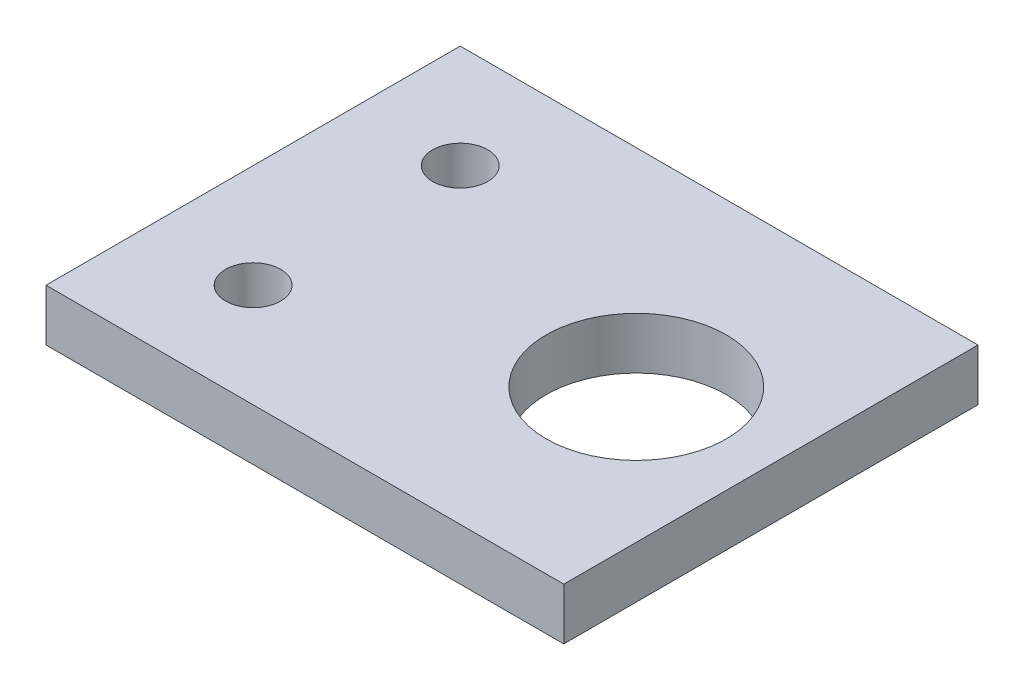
ISO-10303-21;
HEADER;
FILE_DESCRIPTION(('STEP AP214'),'2;1');
FILE_NAME('part.step','',(''),(''),'','','');
FILE_SCHEMA(('AUTOMOTIVE_DESIGN { 1 0 10303 214 1 1 1 1 }'));
ENDSEC;
DATA;
#1=APPLICATION_CONTEXT('core data for automotive mechanical design processes');
#2=APPLICATION_PROTOCOL_DEFINITION('international standard','automotive_design',2000,#1);
#3=PRODUCT_CONTEXT('',#1,'mechanical');
#4=PRODUCT('Part','Part','',(#3));
#5=PRODUCT_RELATED_PRODUCT_CATEGORY('part','',(#4));
#6=PRODUCT_DEFINITION_FORMATION('','',#4);
#7=PRODUCT_DEFINITION_CONTEXT('part definition',#1,'design');
#8=PRODUCT_DEFINITION('design','',#6,#7);
#9=PRODUCT_DEFINITION_SHAPE('','',#8);
#10=(LENGTH_UNIT() NAMED_UNIT(*) SI_UNIT(.MILLI.,.METRE.));
#11=(NAMED_UNIT(*) PLANE_ANGLE_UNIT() SI_UNIT($,.RADIAN.));
#12=(NAMED_UNIT(*) SI_UNIT($,.STERADIAN.) SOLID_ANGLE_UNIT());
#13=UNCERTAINTY_MEASURE_WITH_UNIT(LENGTH_MEASURE(1.E-05),#10,'distance_accuracy_value','');
#14=(GEOMETRIC_REPRESENTATION_CONTEXT(3) GLOBAL_UNCERTAINTY_ASSIGNED_CONTEXT((#13)) GLOBAL_UNIT_ASSIGNED_CONTEXT((#10,
#11,#12)) REPRESENTATION_CONTEXT('',''));
#15=CARTESIAN_POINT('',(0.,0.,0.));
#16=DIRECTION('',(0.,0.,1.));
#17=DIRECTION('',(1.,0.,0.));
#18=AXIS2_PLACEMENT_3D('',#15,#16,#17);
#19=CARTESIAN_POINT('',(-31.75,6.35,-25.4));
#20=DIRECTION('',(1.,0.,0.));
#21=DIRECTION('',(0.,0.,-1.));
#22=AXIS2_PLACEMENT_3D('',#19,#20,#21);
#23=PLANE('',#22);
#24=DIRECTION('',(0.,0.,1.));
#25=VECTOR('',#24,1.);
#26=CARTESIAN_POINT('',(-31.75,0.,-25.4));
#27=LINE('',#26,#25);
#28=CARTESIAN_POINT('',(-31.75,0.,-25.4));
#29=VERTEX_POINT('',#28);
#30=CARTESIAN_POINT('',(-31.75,0.,25.4));
#31=VERTEX_POINT('',#30);
#32=EDGE_CURVE('E119',#29,#31,#27,.T.);
#33=ORIENTED_EDGE('',*,*,#32,.T.);
#34=DIRECTION('',(0.,-1.,0.));
#35=VECTOR('',#34,1.);
#36=CARTESIAN_POINT('',(-31.75,6.35,25.4));
#37=LINE('',#36,#35);
#38=CARTESIAN_POINT('',(-31.75,6.35,25.4));
#39=VERTEX_POINT('',#38);
#40=EDGE_CURVE('E13',#39,#31,#37,.T.);
#41=ORIENTED_EDGE('',*,*,#40,.F.);
#42=DIRECTION('',(0.,0.,1.));
#43=VECTOR('',#42,1.);
#44=CARTESIAN_POINT('',(-31.75,6.35,-25.4));
#45=LINE('',#44,#43);
#46=CARTESIAN_POINT('',(-31.75,6.35,-25.4));
#47=VERTEX_POINT('',#46);
#48=EDGE_CURVE('E102',#47,#39,#45,.T.);
#49=ORIENTED_EDGE('',*,*,#48,.F.);
#50=DIRECTION('',(0.,-1.,0.));
#51=VECTOR('',#50,1.);
#52=CARTESIAN_POINT('',(-31.75,6.35,-25.4));
#53=LINE('',#52,#51);
#54=EDGE_CURVE('E115',#47,#29,#53,.T.);
#55=ORIENTED_EDGE('',*,*,#54,.T.);
#56=EDGE_LOOP('',(#33,#41,#49,#55));
#57=FACE_BOUND('',#56,.T.);
#58=ADVANCED_FACE('F50',(#57),#23,.F.);
#59=CARTESIAN_POINT('',(31.75,6.35,25.4));
#60=DIRECTION('',(0.,0.,-1.));
#61=DIRECTION('',(-1.,0.,0.));
#62=AXIS2_PLACEMENT_3D('',#59,#60,#61);
#63=PLANE('',#62);
#64=DIRECTION('',(1.,0.,0.));
#65=VECTOR('',#64,1.);
#66=CARTESIAN_POINT('',(31.75,0.,25.4));
#67=LINE('',#66,#65);
#68=CARTESIAN_POINT('',(31.75,0.,25.4));
#69=VERTEX_POINT('',#68);
#70=EDGE_CURVE('E107',#31,#69,#67,.T.);
#71=ORIENTED_EDGE('',*,*,#70,.T.);
#72=DIRECTION('',(0.,-1.,0.));
#73=VECTOR('',#72,1.);
#74=CARTESIAN_POINT('',(31.75,6.35,25.4));
#75=LINE('',#74,#73);
#76=CARTESIAN_POINT('',(31.75,6.35,25.4));
#77=VERTEX_POINT('',#76);
#78=EDGE_CURVE('E59',#77,#69,#75,.T.);
#79=ORIENTED_EDGE('',*,*,#78,.F.);
#80=DIRECTION('',(1.,0.,0.));
#81=VECTOR('',#80,1.);
#82=CARTESIAN_POINT('',(31.75,6.35,25.4));
#83=LINE('',#82,#81);
#84=EDGE_CURVE('E97',#39,#77,#83,.T.);
#85=ORIENTED_EDGE('',*,*,#84,.F.);
#86=ORIENTED_EDGE('',*,*,#40,.T.);
#87=EDGE_LOOP('',(#71,#79,#85,#86));
#88=FACE_BOUND('',#87,.T.);
#89=ADVANCED_FACE('F106',(#88),#63,.F.);
#90=CARTESIAN_POINT('',(31.75,6.35,-25.4));
#91=DIRECTION('',(-1.,0.,0.));
#92=DIRECTION('',(0.,0.,1.));
#93=AXIS2_PLACEMENT_3D('',#90,#91,#92);
#94=PLANE('',#93);
#95=DIRECTION('',(0.,0.,-1.));
#96=VECTOR('',#95,1.);
#97=CARTESIAN_POINT('',(31.75,0.,-25.4));
#98=LINE('',#97,#96);
#99=CARTESIAN_POINT('',(31.75,0.,-25.4));
#100=VERTEX_POINT('',#99);
#101=EDGE_CURVE('E84',#69,#100,#98,.T.);
#102=ORIENTED_EDGE('',*,*,#101,.T.);
#103=DIRECTION('',(0.,-1.,0.));
#104=VECTOR('',#103,1.);
#105=CARTESIAN_POINT('',(31.75,6.35,-25.4));
#106=LINE('',#105,#104);
#107=CARTESIAN_POINT('',(31.75,6.35,-25.4));
#108=VERTEX_POINT('',#107);
#109=EDGE_CURVE('E109',#108,#100,#106,.T.);
#110=ORIENTED_EDGE('',*,*,#109,.F.);
#111=DIRECTION('',(0.,0.,-1.));
#112=VECTOR('',#111,1.);
#113=CARTESIAN_POINT('',(31.75,6.35,-25.4));
#114=LINE('',#113,#112);
#115=EDGE_CURVE('E100',#77,#108,#114,.T.);
#116=ORIENTED_EDGE('',*,*,#115,.F.);
#117=ORIENTED_EDGE('',*,*,#78,.T.);
#118=EDGE_LOOP('',(#102,#110,#116,#117));
#119=FACE_BOUND('',#118,.T.);
#120=ADVANCED_FACE('F110',(#119),#94,.F.);
#121=CARTESIAN_POINT('',(31.75,6.35,-25.4));
#122=DIRECTION('',(0.,0.,1.));
#123=DIRECTION('',(1.,0.,0.));
#124=AXIS2_PLACEMENT_3D('',#121,#122,#123);
#125=PLANE('',#124);
#126=DIRECTION('',(-1.,0.,0.));
#127=VECTOR('',#126,1.);
#128=CARTESIAN_POINT('',(31.75,0.,-25.4));
#129=LINE('',#128,#127);
#130=EDGE_CURVE('E90',#100,#29,#129,.T.);
#131=ORIENTED_EDGE('',*,*,#130,.T.);
#132=ORIENTED_EDGE('',*,*,#54,.F.);
#133=DIRECTION('',(-1.,0.,0.));
#134=VECTOR('',#133,1.);
#135=CARTESIAN_POINT('',(31.75,6.35,-25.4));
#136=LINE('',#135,#134);
#137=EDGE_CURVE('E67',#108,#47,#136,.T.);
#138=ORIENTED_EDGE('',*,*,#137,.F.);
#139=ORIENTED_EDGE('',*,*,#109,.T.);
#140=EDGE_LOOP('',(#131,#132,#138,#139));
#141=FACE_BOUND('',#140,.T.);
#142=ADVANCED_FACE('F134',(#141),#125,.F.);
#143=CARTESIAN_POINT('',(0.,6.35,0.));
#144=DIRECTION('',(0.,-1.,0.));
#145=DIRECTION('',(0.,0.,-1.));
#146=AXIS2_PLACEMENT_3D('',#143,#144,#145);
#147=PLANE('',#146);
#148=CARTESIAN_POINT('',(15.24,6.35,0.));
#149=DIRECTION('',(0.,1.,0.));
#150=DIRECTION('',(0.,0.,1.));
#151=AXIS2_PLACEMENT_3D('',#148,#149,#150);
#152=CIRCLE('',#151,11.049);
#153=CARTESIAN_POINT('',(15.24,6.35,11.049));
#154=VERTEX_POINT('',#153);
#155=EDGE_CURVE('E158',#154,#154,#152,.T.);
#156=ORIENTED_EDGE('',*,*,#155,.F.);
#157=EDGE_LOOP('',(#156));
#158=FACE_BOUND('',#157,.T.);
#159=CARTESIAN_POINT('',(-19.05,6.35,12.7));
#160=DIRECTION('',(0.,1.,0.));
#161=DIRECTION('',(0.,0.,1.));
#162=AXIS2_PLACEMENT_3D('',#159,#160,#161);
#163=CIRCLE('',#162,3.3782);
#164=CARTESIAN_POINT('',(-19.05,6.35,16.0782));
#165=VERTEX_POINT('',#164);
#166=EDGE_CURVE('E153',#165,#165,#163,.T.);
#167=ORIENTED_EDGE('',*,*,#166,.F.);
#168=EDGE_LOOP('',(#167));
#169=FACE_BOUND('',#168,.T.);
#170=CARTESIAN_POINT('',(-19.05,6.35,-12.7));
#171=DIRECTION('',(0.,1.,0.));
#172=DIRECTION('',(0.,0.,1.));
#173=AXIS2_PLACEMENT_3D('',#170,#171,#172);
#174=CIRCLE('',#173,3.3782);
#175=CARTESIAN_POINT('',(-19.05,6.35,-9.3218));
#176=VERTEX_POINT('',#175);
#177=EDGE_CURVE('E145',#176,#176,#174,.T.);
#178=ORIENTED_EDGE('',*,*,#177,.F.);
#179=EDGE_LOOP('',(#178));
#180=FACE_BOUND('',#179,.T.);
#181=ORIENTED_EDGE('',*,*,#48,.T.);
#182=ORIENTED_EDGE('',*,*,#84,.T.);
#183=ORIENTED_EDGE('',*,*,#115,.T.);
#184=ORIENTED_EDGE('',*,*,#137,.T.);
#185=EDGE_LOOP('',(#181,#182,#183,#184));
#186=FACE_BOUND('',#185,.T.);
#187=ADVANCED_FACE('F98',(#158,#169,#180,#186),#147,.F.);
#188=CARTESIAN_POINT('',(0.,0.,0.));
#189=DIRECTION('',(0.,-1.,0.));
#190=DIRECTION('',(0.,0.,-1.));
#191=AXIS2_PLACEMENT_3D('',#188,#189,#190);
#192=PLANE('',#191);
#193=CARTESIAN_POINT('',(15.24,0.,0.));
#194=DIRECTION('',(0.,1.,0.));
#195=DIRECTION('',(0.,0.,1.));
#196=AXIS2_PLACEMENT_3D('',#193,#194,#195);
#197=CIRCLE('',#196,11.049);
#198=CARTESIAN_POINT('',(15.24,0.,11.049));
#199=VERTEX_POINT('',#198);
#200=EDGE_CURVE('E157',#199,#199,#197,.T.);
#201=ORIENTED_EDGE('',*,*,#200,.T.);
#202=EDGE_LOOP('',(#201));
#203=FACE_BOUND('',#202,.T.);
#204=CARTESIAN_POINT('',(-19.05,0.,12.7));
#205=DIRECTION('',(0.,1.,0.));
#206=DIRECTION('',(0.,0.,1.));
#207=AXIS2_PLACEMENT_3D('',#204,#205,#206);
#208=CIRCLE('',#207,3.3782);
#209=CARTESIAN_POINT('',(-19.05,0.,16.0782));
#210=VERTEX_POINT('',#209);
#211=EDGE_CURVE('E149',#210,#210,#208,.T.);
#212=ORIENTED_EDGE('',*,*,#211,.T.);
#213=EDGE_LOOP('',(#212));
#214=FACE_BOUND('',#213,.T.);
#215=CARTESIAN_POINT('',(-19.05,0.,-12.7));
#216=DIRECTION('',(0.,1.,0.));
#217=DIRECTION('',(0.,0.,1.));
#218=AXIS2_PLACEMENT_3D('',#215,#216,#217);
#219=CIRCLE('',#218,3.3782);
#220=CARTESIAN_POINT('',(-19.05,0.,-9.3218));
#221=VERTEX_POINT('',#220);
#222=EDGE_CURVE('E123',#221,#221,#219,.T.);
#223=ORIENTED_EDGE('',*,*,#222,.T.);
#224=EDGE_LOOP('',(#223));
#225=FACE_BOUND('',#224,.T.);
#226=ORIENTED_EDGE('',*,*,#32,.F.);
#227=ORIENTED_EDGE('',*,*,#130,.F.);
#228=ORIENTED_EDGE('',*,*,#101,.F.);
#229=ORIENTED_EDGE('',*,*,#70,.F.);
#230=EDGE_LOOP('',(#226,#227,#228,#229));
#231=FACE_BOUND('',#230,.T.);
#232=ADVANCED_FACE('F137',(#203,#214,#225,#231),#192,.T.);
#233=CARTESIAN_POINT('',(-19.05,6.35,-12.7));
#234=DIRECTION('',(0.,1.,0.));
#235=DIRECTION('',(0.,0.,1.));
#236=AXIS2_PLACEMENT_3D('',#233,#234,#235);
#237=CYLINDRICAL_SURFACE('',#236,3.3782);
#238=ORIENTED_EDGE('',*,*,#222,.F.);
#239=EDGE_LOOP('',(#238));
#240=FACE_BOUND('',#239,.T.);
#241=ORIENTED_EDGE('',*,*,#177,.T.);
#242=EDGE_LOOP('',(#241));
#243=FACE_BOUND('',#242,.T.);
#244=ADVANCED_FACE('F183',(#240,#243),#237,.F.);
#245=CARTESIAN_POINT('',(-19.05,6.35,12.7));
#246=DIRECTION('',(0.,1.,0.));
#247=DIRECTION('',(0.,0.,1.));
#248=AXIS2_PLACEMENT_3D('',#245,#246,#247);
#249=CYLINDRICAL_SURFACE('',#248,3.3782);
#250=ORIENTED_EDGE('',*,*,#211,.F.);
#251=EDGE_LOOP('',(#250));
#252=FACE_BOUND('',#251,.T.);
#253=ORIENTED_EDGE('',*,*,#166,.T.);
#254=EDGE_LOOP('',(#253));
#255=FACE_BOUND('',#254,.T.);
#256=ADVANCED_FACE('F172',(#252,#255),#249,.F.);
#257=CARTESIAN_POINT('',(15.24,0.,0.));
#258=DIRECTION('',(0.,1.,0.));
#259=DIRECTION('',(0.,0.,1.));
#260=AXIS2_PLACEMENT_3D('',#257,#258,#259);
#261=CYLINDRICAL_SURFACE('',#260,11.049);
#262=ORIENTED_EDGE('',*,*,#200,.F.);
#263=EDGE_LOOP('',(#262));
#264=FACE_BOUND('',#263,.T.);
#265=ORIENTED_EDGE('',*,*,#155,.T.);
#266=EDGE_LOOP('',(#265));
#267=FACE_BOUND('',#266,.T.);
#268=ADVANCED_FACE('F169',(#264,#267),#261,.F.);
#269=CLOSED_SHELL('',(#58,#89,#120,#142,#187,#232,#244,#256,#268));
#270=MANIFOLD_SOLID_BREP('B2',#269);
#271=ADVANCED_BREP_SHAPE_REPRESENTATION('',(#18,#270),#14);
#272=SHAPE_DEFINITION_REPRESENTATION(#9,#271);
ENDSEC;
END-ISO-10303-21;
